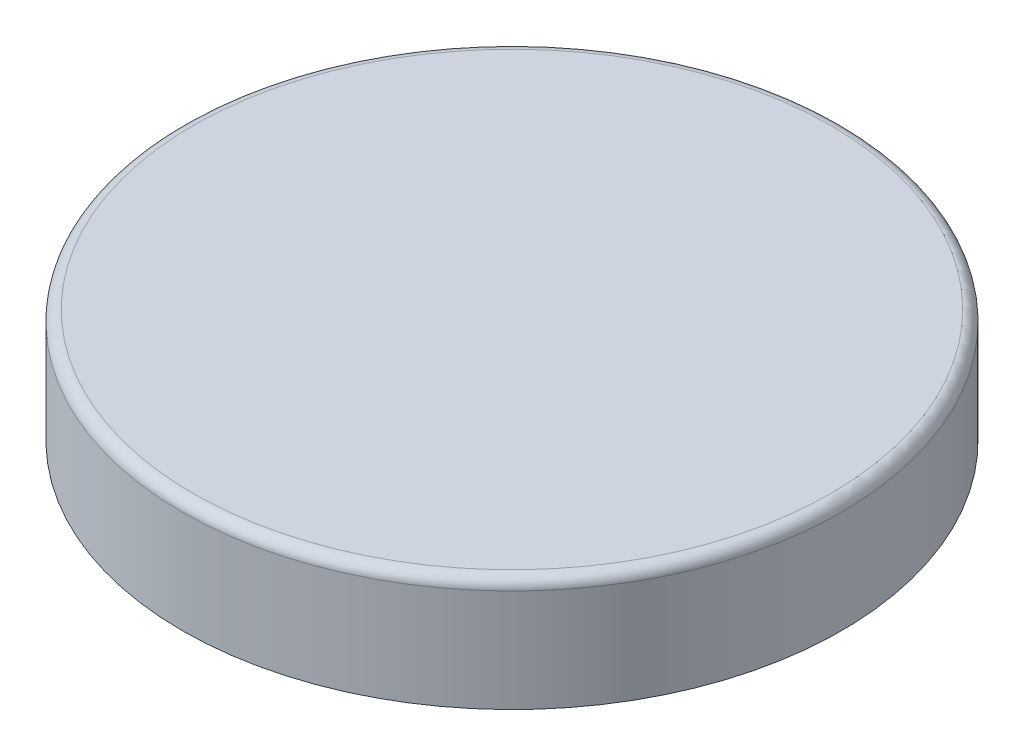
from build123d import *

# Parameters (mm, degrees)
ESQUISSE2_R                = 59
ESQUISSE2_R_2              = 2.5
BOSS_EXTRU_1_DEPTH         = 0.1
ESQUISSE3_R                = 2
BOSS_EXTRU_2_DEPTH         = 10
R_P_TITION_LIN_AIRE1_COUNT = 22
R_P_TITION_LIN_AIRE1_PITCH = 0.45


with BuildPart() as part:
    # Esquisse1 → R_vol.-Mince1 (revolve)
    with BuildSketch(Plane.XY, mode=Mode.PRIVATE) as r_vol_mince1_sk:
        with BuildLine():
            Line((0, 21), (59, 21))
            ThreePointArc((59, 21), (60.414213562, 20.414213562), (61, 19))
            Line((61, 19), (61, 0))
            Line((61, 0), (59.5, 0))
            Line((59.5, 0), (59.5, 19))
            ThreePointArc((59.5, 19), (59.353553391, 19.353553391), (59, 19.5))
            Line((59, 19.5), (0, 19.5))
            Line((0, 19.5), (0, 21))
        make_face()
    revolve(r_vol_mince1_sk.sketch.rotate(Axis((0, 0, 0), (0, 1, 0)), 90), axis=Axis((0, 0, 0), (0, 1, 0)))



with BuildPart() as body_2:
    # Esquisse2 → Boss.-Extru.1 (new body)
    with BuildSketch(Plane.XZ.offset(-19.5)):
        with Locations(Location((0, 0, 0), (0, 0, 270))):
            Circle(ESQUISSE2_R)
        with Locations(Location((0, 0, 0), (0, 0, 270))):
            Circle(ESQUISSE2_R_2, mode=Mode.SUBTRACT)
    extrude(amount=BOSS_EXTRU_1_DEPTH)


with BuildPart() as part_1:
    add(part.part)

    add(body_2.part)  # Boss.-Extru.2 merges body 2
    # Esquisse3 → Boss.-Extru.2 (add)
    with BuildSketch(Plane.XZ.offset(-19.5)):
        with Locations(Location((0, 0, 0), (0, 0, 270))):
            Circle(ESQUISSE3_R)
    extrude(amount=BOSS_EXTRU_2_DEPTH)

    # Esquisse4 → Enl_vement de mati_re-R_volution1 (revolve, cut)
    with BuildSketch(Plane.XY, mode=Mode.PRIVATE) as enl_vement_de_mati_re_r_volution1_sk:
        Polygon((1.5, 9.5), (2, 9.788675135), (2, 9.211324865), align=None)
    enl_vement_de_mati_re_r_volution1 = revolve(enl_vement_de_mati_re_r_volution1_sk.sketch.rotate(Axis((0, 0, 0), (0, 1, 0)), 90), axis=Axis((0, 0, 0), (0, 1, 0)), mode=Mode.SUBTRACT)

    # R_p_tition lin_aire1: Enl_vement de mati_re-R_volution1 ×22
    with Locations(*[(0, i * R_P_TITION_LIN_AIRE1_PITCH, 0) for i in range(1, R_P_TITION_LIN_AIRE1_COUNT)]):
        add(enl_vement_de_mati_re_r_volution1, mode=Mode.SUBTRACT)


solid = part_1.part
